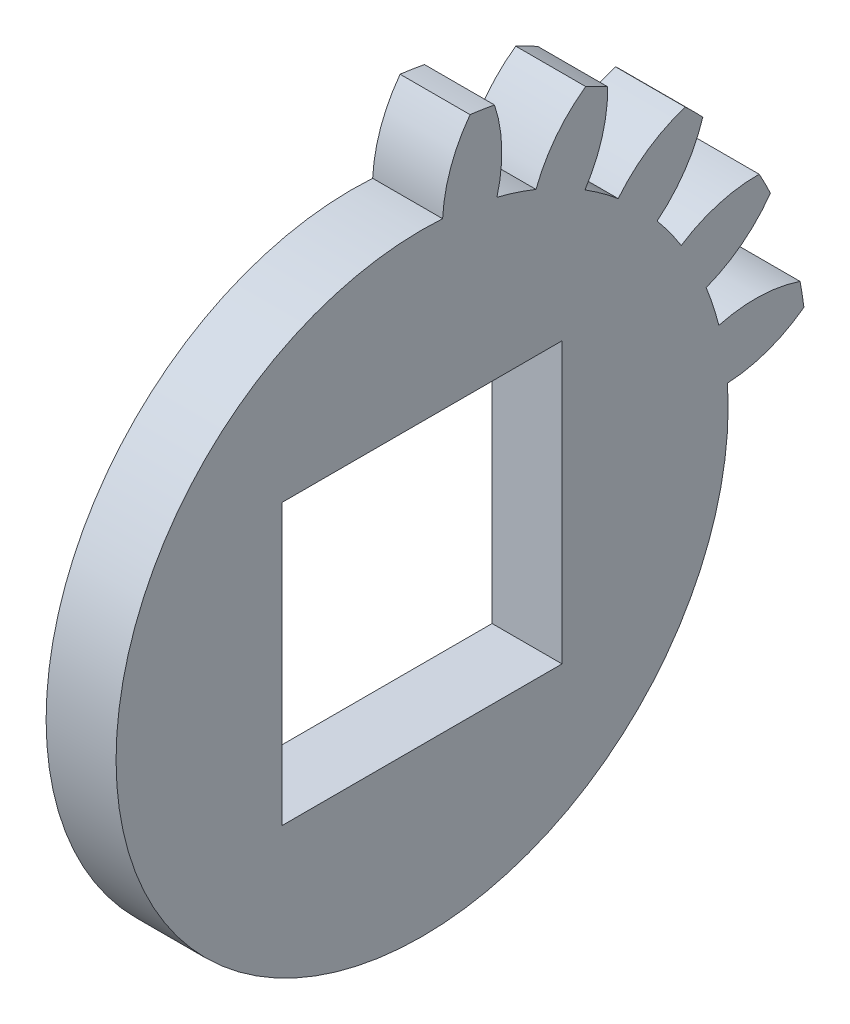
ISO-10303-21;
HEADER;
FILE_DESCRIPTION(('STEP AP214'),'2;1');
FILE_NAME('part.step','',(''),(''),'','','');
FILE_SCHEMA(('AUTOMOTIVE_DESIGN { 1 0 10303 214 1 1 1 1 }'));
ENDSEC;
DATA;
#1=APPLICATION_CONTEXT('core data for automotive mechanical design processes');
#2=APPLICATION_PROTOCOL_DEFINITION('international standard','automotive_design',2000,#1);
#3=PRODUCT_CONTEXT('',#1,'mechanical');
#4=PRODUCT('Part','Part','',(#3));
#5=PRODUCT_RELATED_PRODUCT_CATEGORY('part','',(#4));
#6=PRODUCT_DEFINITION_FORMATION('','',#4);
#7=PRODUCT_DEFINITION_CONTEXT('part definition',#1,'design');
#8=PRODUCT_DEFINITION('design','',#6,#7);
#9=PRODUCT_DEFINITION_SHAPE('','',#8);
#10=(LENGTH_UNIT() NAMED_UNIT(*) SI_UNIT(.MILLI.,.METRE.));
#11=(NAMED_UNIT(*) PLANE_ANGLE_UNIT() SI_UNIT($,.RADIAN.));
#12=(NAMED_UNIT(*) SI_UNIT($,.STERADIAN.) SOLID_ANGLE_UNIT());
#13=UNCERTAINTY_MEASURE_WITH_UNIT(LENGTH_MEASURE(1.E-05),#10,'distance_accuracy_value','');
#14=(GEOMETRIC_REPRESENTATION_CONTEXT(3) GLOBAL_UNCERTAINTY_ASSIGNED_CONTEXT((#13)) GLOBAL_UNIT_ASSIGNED_CONTEXT((#10,
#11,#12)) REPRESENTATION_CONTEXT('',''));
#15=CARTESIAN_POINT('',(0.,0.,0.));
#16=DIRECTION('',(0.,0.,1.));
#17=DIRECTION('',(1.,0.,0.));
#18=AXIS2_PLACEMENT_3D('',#15,#16,#17);
#19=CARTESIAN_POINT('',(2.38125,0.399546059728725,-0.399546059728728));
#20=DIRECTION('',(-1.,0.,0.));
#21=DIRECTION('',(0.,0.,1.));
#22=AXIS2_PLACEMENT_3D('',#19,#20,#21);
#23=PLANE('',#22);
#24=DIRECTION('',(0.,0.,-1.));
#25=VECTOR('',#24,1.);
#26=CARTESIAN_POINT('',(2.38125,-2.77545394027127,-3.57454605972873));
#27=LINE('',#26,#25);
#28=CARTESIAN_POINT('',(2.38125,-2.77545394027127,2.77545394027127));
#29=VERTEX_POINT('',#28);
#30=CARTESIAN_POINT('',(2.38125,-2.77545394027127,-3.57454605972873));
#31=VERTEX_POINT('',#30);
#32=EDGE_CURVE('E207',#29,#31,#27,.T.);
#33=ORIENTED_EDGE('',*,*,#32,.F.);
#34=DIRECTION('',(0.,-1.,0.));
#35=VECTOR('',#34,1.);
#36=CARTESIAN_POINT('',(2.38125,3.57454605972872,2.77545394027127));
#37=LINE('',#36,#35);
#38=CARTESIAN_POINT('',(2.38125,3.57454605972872,2.77545394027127));
#39=VERTEX_POINT('',#38);
#40=EDGE_CURVE('E49',#39,#29,#37,.T.);
#41=ORIENTED_EDGE('',*,*,#40,.F.);
#42=DIRECTION('',(0.,0.,1.));
#43=VECTOR('',#42,1.);
#44=CARTESIAN_POINT('',(2.38125,3.57454605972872,-3.57454605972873));
#45=LINE('',#44,#43);
#46=CARTESIAN_POINT('',(2.38125,3.57454605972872,-3.57454605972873));
#47=VERTEX_POINT('',#46);
#48=EDGE_CURVE('E213',#47,#39,#45,.T.);
#49=ORIENTED_EDGE('',*,*,#48,.F.);
#50=DIRECTION('',(0.,1.,0.));
#51=VECTOR('',#50,1.);
#52=CARTESIAN_POINT('',(2.38125,3.57454605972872,-3.57454605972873));
#53=LINE('',#52,#51);
#54=EDGE_CURVE('E198',#31,#47,#53,.T.);
#55=ORIENTED_EDGE('',*,*,#54,.F.);
#56=EDGE_LOOP('',(#33,#41,#49,#55));
#57=FACE_BOUND('',#56,.T.);
#58=CARTESIAN_POINT('',(2.38125,0.399546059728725,-0.399546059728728));
#59=DIRECTION('',(-1.,0.,0.));
#60=DIRECTION('',(0.,0.,-1.));
#61=AXIS2_PLACEMENT_3D('',#58,#59,#60);
#62=CIRCLE('',#61,6.9446775);
#63=CARTESIAN_POINT('',(2.38125,0.864922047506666,-7.32861315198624));
#64=VERTEX_POINT('',#63);
#65=CARTESIAN_POINT('',(2.38125,7.32861315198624,-0.864922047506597));
#66=VERTEX_POINT('',#65);
#67=EDGE_CURVE('E321',#64,#66,#62,.T.);
#68=ORIENTED_EDGE('',*,*,#67,.F.);
#69=CARTESIAN_POINT('',(2.38125,4.03592755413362,-7.16939921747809));
#70=DIRECTION('',(-1.,0.,0.));
#71=DIRECTION('',(0.,-1.,0.));
#72=AXIS2_PLACEMENT_3D('',#69,#70,#71);
#73=CIRCLE('',#72,3.175);
#74=CARTESIAN_POINT('',(2.38125,1.48725431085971,-9.06277971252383));
#75=VERTEX_POINT('',#74);
#76=EDGE_CURVE('E309',#75,#64,#73,.T.);
#77=ORIENTED_EDGE('',*,*,#76,.F.);
#78=CARTESIAN_POINT('',(2.38125,0.399546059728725,-0.399546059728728));
#79=DIRECTION('',(-1.,0.,0.));
#80=DIRECTION('',(0.,0.,1.));
#81=AXIS2_PLACEMENT_3D('',#78,#79,#80);
#82=CIRCLE('',#81,8.73125);
#83=CARTESIAN_POINT('',(2.38125,2.04216046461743,-8.97489121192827));
#84=VERTEX_POINT('',#83);
#85=EDGE_CURVE('E336',#84,#75,#82,.T.);
#86=ORIENTED_EDGE('',*,*,#85,.F.);
#87=CARTESIAN_POINT('',(2.38125,-0.966858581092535,-7.96176269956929));
#88=DIRECTION('',(-1.,0.,0.));
#89=DIRECTION('',(0.,-0.95105651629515,-0.309016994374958));
#90=AXIS2_PLACEMENT_3D('',#87,#88,#89);
#91=CIRCLE('',#90,3.175);
#92=CARTESIAN_POINT('',(2.38125,2.09814668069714,-7.13328955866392));
#93=VERTEX_POINT('',#92);
#94=EDGE_CURVE('E288',#93,#84,#91,.T.);
#95=ORIENTED_EDGE('',*,*,#94,.F.);
#96=CARTESIAN_POINT('',(2.38125,0.399546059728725,-0.399546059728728));
#97=DIRECTION('',(-1.,0.,0.));
#98=DIRECTION('',(0.,-0.95105651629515,-0.309016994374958));
#99=AXIS2_PLACEMENT_3D('',#96,#97,#98);
#100=CIRCLE('',#99,6.9446775);
#101=CARTESIAN_POINT('',(2.38125,2.98334441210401,-6.84567138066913));
#102=VERTEX_POINT('',#101);
#103=EDGE_CURVE('E293',#102,#93,#100,.T.);
#104=ORIENTED_EDGE('',*,*,#103,.F.);
#105=CARTESIAN_POINT('',(2.38125,5.94995005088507,-5.7143553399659));
#106=DIRECTION('',(-1.,0.,0.));
#107=DIRECTION('',(0.,-0.95105651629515,-0.309016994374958));
#108=AXIS2_PLACEMENT_3D('',#105,#106,#107);
#109=CIRCLE('',#108,3.175);
#110=CARTESIAN_POINT('',(2.38125,4.1111045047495,-8.30265054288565));
#111=VERTEX_POINT('',#110);
#112=EDGE_CURVE('E290',#111,#102,#109,.T.);
#113=ORIENTED_EDGE('',*,*,#112,.F.);
#114=CARTESIAN_POINT('',(2.38125,4.6116925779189,-8.04758817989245));
#115=VERTEX_POINT('',#114);
#116=EDGE_CURVE('E469',#115,#111,#82,.T.);
#117=ORIENTED_EDGE('',*,*,#116,.F.);
#118=CARTESIAN_POINT('',(2.38125,1.43687147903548,-8.0138837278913));
#119=DIRECTION('',(-1.,0.,0.));
#120=DIRECTION('',(0.,-0.80901699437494,-0.587785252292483));
#121=AXIS2_PLACEMENT_3D('',#118,#119,#120);
#122=CIRCLE('',#121,3.175);
#123=CARTESIAN_POINT('',(2.38125,4.09585242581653,-6.27882023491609));
#124=VERTEX_POINT('',#123);
#125=EDGE_CURVE('E266',#124,#115,#122,.T.);
#126=ORIENTED_EDGE('',*,*,#125,.F.);
#127=CARTESIAN_POINT('',(2.38125,0.399546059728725,-0.399546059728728));
#128=DIRECTION('',(-1.,0.,0.));
#129=DIRECTION('',(0.,-0.80901699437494,-0.587785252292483));
#130=AXIS2_PLACEMENT_3D('',#127,#128,#129);
#131=CIRCLE('',#130,6.9446775);
#132=CARTESIAN_POINT('',(2.38125,4.84884659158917,-5.73173795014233));
#133=VERTEX_POINT('',#132);
#134=EDGE_CURVE('E271',#133,#124,#131,.T.);
#135=ORIENTED_EDGE('',*,*,#134,.F.);
#136=CARTESIAN_POINT('',(2.38125,7.32066033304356,-3.73906089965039));
#137=DIRECTION('',(-1.,0.,0.));
#138=DIRECTION('',(0.,-0.80901699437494,-0.587785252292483));
#139=AXIS2_PLACEMENT_3D('',#136,#137,#138);
#140=CIRCLE('',#139,3.175);
#141=CARTESIAN_POINT('',(2.38125,6.37164149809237,-6.76891044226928));
#142=VERTEX_POINT('',#141);
#143=EDGE_CURVE('E268',#142,#133,#140,.T.);
#144=ORIENTED_EDGE('',*,*,#143,.F.);
#145=CARTESIAN_POINT('',(2.38125,6.76891044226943,-6.37164149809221));
#146=VERTEX_POINT('',#145);
#147=EDGE_CURVE('E470',#146,#142,#82,.T.);
#148=ORIENTED_EDGE('',*,*,#147,.F.);
#149=CARTESIAN_POINT('',(2.38125,3.73906089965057,-7.32066033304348));
#150=DIRECTION('',(-1.,0.,0.));
#151=DIRECTION('',(0.,-0.587785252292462,-0.809016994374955));
#152=AXIS2_PLACEMENT_3D('',#149,#150,#151);
#153=CIRCLE('',#152,3.175);
#154=CARTESIAN_POINT('',(2.38125,5.73173795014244,-4.84884659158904));
#155=VERTEX_POINT('',#154);
#156=EDGE_CURVE('E244',#155,#146,#153,.T.);
#157=ORIENTED_EDGE('',*,*,#156,.F.);
#158=CARTESIAN_POINT('',(2.38125,0.399546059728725,-0.399546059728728));
#159=DIRECTION('',(-1.,0.,0.));
#160=DIRECTION('',(0.,-0.587785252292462,-0.809016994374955));
#161=AXIS2_PLACEMENT_3D('',#158,#159,#160);
#162=CIRCLE('',#161,6.9446775);
#163=CARTESIAN_POINT('',(2.38125,6.27882023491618,-4.09585242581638));
#164=VERTEX_POINT('',#163);
#165=EDGE_CURVE('E249',#164,#155,#162,.T.);
#166=ORIENTED_EDGE('',*,*,#165,.F.);
#167=CARTESIAN_POINT('',(2.38125,8.01388372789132,-1.43687147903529));
#168=DIRECTION('',(-1.,0.,0.));
#169=DIRECTION('',(0.,-0.587785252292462,-0.809016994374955));
#170=AXIS2_PLACEMENT_3D('',#167,#168,#169);
#171=CIRCLE('',#170,3.175);
#172=CARTESIAN_POINT('',(2.38125,8.04758817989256,-4.6116925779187));
#173=VERTEX_POINT('',#172);
#174=EDGE_CURVE('E246',#173,#164,#171,.T.);
#175=ORIENTED_EDGE('',*,*,#174,.F.);
#176=CARTESIAN_POINT('',(2.38125,8.30265054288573,-4.11110450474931));
#177=VERTEX_POINT('',#176);
#178=EDGE_CURVE('E342',#177,#173,#82,.T.);
#179=ORIENTED_EDGE('',*,*,#178,.F.);
#180=CARTESIAN_POINT('',(2.38125,5.71435533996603,-5.94995005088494));
#181=DIRECTION('',(-1.,0.,0.));
#182=DIRECTION('',(0.,-0.309016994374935,-0.951056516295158));
#183=AXIS2_PLACEMENT_3D('',#180,#181,#182);
#184=CIRCLE('',#183,3.175);
#185=CARTESIAN_POINT('',(2.38125,6.84567138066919,-2.98334441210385));
#186=VERTEX_POINT('',#185);
#187=EDGE_CURVE('E223',#186,#177,#184,.T.);
#188=ORIENTED_EDGE('',*,*,#187,.F.);
#189=CARTESIAN_POINT('',(2.38125,0.399546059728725,-0.399546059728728));
#190=DIRECTION('',(-1.,0.,0.));
#191=DIRECTION('',(0.,-0.309016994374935,-0.951056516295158));
#192=AXIS2_PLACEMENT_3D('',#189,#190,#191);
#193=CIRCLE('',#192,6.9446775);
#194=CARTESIAN_POINT('',(2.38125,7.13328955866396,-2.09814668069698));
#195=VERTEX_POINT('',#194);
#196=EDGE_CURVE('E228',#195,#186,#193,.T.);
#197=ORIENTED_EDGE('',*,*,#196,.F.);
#198=CARTESIAN_POINT('',(2.38125,7.96176269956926,0.966858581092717));
#199=DIRECTION('',(-1.,0.,0.));
#200=DIRECTION('',(0.,-0.309016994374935,-0.951056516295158));
#201=AXIS2_PLACEMENT_3D('',#198,#199,#200);
#202=CIRCLE('',#201,3.175);
#203=CARTESIAN_POINT('',(2.38125,8.9748912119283,-2.04216046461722));
#204=VERTEX_POINT('',#203);
#205=EDGE_CURVE('E225',#204,#195,#202,.T.);
#206=ORIENTED_EDGE('',*,*,#205,.F.);
#207=CARTESIAN_POINT('',(2.38125,9.06277971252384,-1.48725431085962));
#208=VERTEX_POINT('',#207);
#209=EDGE_CURVE('E338',#208,#204,#82,.T.);
#210=ORIENTED_EDGE('',*,*,#209,.F.);
#211=CARTESIAN_POINT('',(2.38125,7.16939921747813,-4.03592755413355));
#212=DIRECTION('',(-1.,0.,0.));
#213=DIRECTION('',(0.,0.,-1.));
#214=AXIS2_PLACEMENT_3D('',#211,#212,#213);
#215=CIRCLE('',#214,3.175);
#216=EDGE_CURVE('E319',#66,#208,#215,.T.);
#217=ORIENTED_EDGE('',*,*,#216,.F.);
#218=EDGE_LOOP('',(#68,#77,#86,#95,#104,#113,#117,#126,#135,#144,#148,#157,#166,#175,#179,#188,
#197,#206,#210,#217));
#219=FACE_BOUND('',#218,.T.);
#220=ADVANCED_FACE('F35',(#57,#219),#23,.F.);
#221=CARTESIAN_POINT('',(0.79375,0.399546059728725,-0.399546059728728));
#222=DIRECTION('',(1.,0.,0.));
#223=DIRECTION('',(0.,0.,-1.));
#224=AXIS2_PLACEMENT_3D('',#221,#222,#223);
#225=PLANE('',#224);
#226=DIRECTION('',(0.,0.,1.));
#227=VECTOR('',#226,1.);
#228=CARTESIAN_POINT('',(0.79375,3.57454605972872,-0.399546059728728));
#229=LINE('',#228,#227);
#230=CARTESIAN_POINT('',(0.79375,3.57454605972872,-3.57454605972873));
#231=VERTEX_POINT('',#230);
#232=CARTESIAN_POINT('',(0.79375,3.57454605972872,2.77545394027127));
#233=VERTEX_POINT('',#232);
#234=EDGE_CURVE('E42',#231,#233,#229,.T.);
#235=ORIENTED_EDGE('',*,*,#234,.T.);
#236=DIRECTION('',(0.,-1.,0.));
#237=VECTOR('',#236,1.);
#238=CARTESIAN_POINT('',(0.79375,0.399546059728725,2.77545394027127));
#239=LINE('',#238,#237);
#240=CARTESIAN_POINT('',(0.79375,-2.77545394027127,2.77545394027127));
#241=VERTEX_POINT('',#240);
#242=EDGE_CURVE('E11',#233,#241,#239,.T.);
#243=ORIENTED_EDGE('',*,*,#242,.T.);
#244=DIRECTION('',(0.,0.,-1.));
#245=VECTOR('',#244,1.);
#246=CARTESIAN_POINT('',(0.79375,-2.77545394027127,-0.399546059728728));
#247=LINE('',#246,#245);
#248=CARTESIAN_POINT('',(0.79375,-2.77545394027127,-3.57454605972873));
#249=VERTEX_POINT('',#248);
#250=EDGE_CURVE('E356',#241,#249,#247,.T.);
#251=ORIENTED_EDGE('',*,*,#250,.T.);
#252=DIRECTION('',(0.,1.,0.));
#253=VECTOR('',#252,1.);
#254=CARTESIAN_POINT('',(0.79375,0.399546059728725,-3.57454605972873));
#255=LINE('',#254,#253);
#256=EDGE_CURVE('E201',#249,#231,#255,.T.);
#257=ORIENTED_EDGE('',*,*,#256,.T.);
#258=EDGE_LOOP('',(#235,#243,#251,#257));
#259=FACE_BOUND('',#258,.T.);
#260=CARTESIAN_POINT('',(0.79375,4.03592755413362,-7.16939921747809));
#261=DIRECTION('',(1.,0.,0.));
#262=DIRECTION('',(0.,0.,-1.));
#263=AXIS2_PLACEMENT_3D('',#260,#261,#262);
#264=CIRCLE('',#263,3.175);
#265=CARTESIAN_POINT('',(0.79375,0.864922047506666,-7.32861315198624));
#266=VERTEX_POINT('',#265);
#267=CARTESIAN_POINT('',(0.79375,1.48725431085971,-9.06277971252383));
#268=VERTEX_POINT('',#267);
#269=EDGE_CURVE('E341',#266,#268,#264,.T.);
#270=ORIENTED_EDGE('',*,*,#269,.F.);
#271=CARTESIAN_POINT('',(0.79375,0.399546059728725,-0.399546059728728));
#272=DIRECTION('',(-1.,0.,0.));
#273=DIRECTION('',(0.,0.,-1.));
#274=AXIS2_PLACEMENT_3D('',#271,#272,#273);
#275=CIRCLE('',#274,6.9446775);
#276=CARTESIAN_POINT('',(0.79375,7.32861315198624,-0.864922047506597));
#277=VERTEX_POINT('',#276);
#278=EDGE_CURVE('E322',#266,#277,#275,.T.);
#279=ORIENTED_EDGE('',*,*,#278,.T.);
#280=CARTESIAN_POINT('',(0.79375,7.16939921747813,-4.03592755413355));
#281=DIRECTION('',(-1.,0.,0.));
#282=DIRECTION('',(0.,0.,-1.));
#283=AXIS2_PLACEMENT_3D('',#280,#281,#282);
#284=CIRCLE('',#283,3.175);
#285=CARTESIAN_POINT('',(0.79375,9.06277971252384,-1.48725431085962));
#286=VERTEX_POINT('',#285);
#287=EDGE_CURVE('E318',#277,#286,#284,.T.);
#288=ORIENTED_EDGE('',*,*,#287,.T.);
#289=CARTESIAN_POINT('',(0.79375,0.399546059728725,-0.399546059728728));
#290=DIRECTION('',(-1.,0.,0.));
#291=DIRECTION('',(0.,0.,1.));
#292=AXIS2_PLACEMENT_3D('',#289,#290,#291);
#293=CIRCLE('',#292,8.73125);
#294=CARTESIAN_POINT('',(0.79375,8.9748912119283,-2.04216046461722));
#295=VERTEX_POINT('',#294);
#296=EDGE_CURVE('E333',#286,#295,#293,.T.);
#297=ORIENTED_EDGE('',*,*,#296,.T.);
#298=CARTESIAN_POINT('',(0.79375,7.96176269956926,0.966858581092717));
#299=DIRECTION('',(1.,0.,0.));
#300=DIRECTION('',(0.,0.,-1.));
#301=AXIS2_PLACEMENT_3D('',#298,#299,#300);
#302=CIRCLE('',#301,3.175);
#303=CARTESIAN_POINT('',(0.79375,7.13328955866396,-2.09814668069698));
#304=VERTEX_POINT('',#303);
#305=EDGE_CURVE('E354',#304,#295,#302,.T.);
#306=ORIENTED_EDGE('',*,*,#305,.F.);
#307=CARTESIAN_POINT('',(0.79375,0.399546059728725,-0.399546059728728));
#308=DIRECTION('',(-1.,0.,0.));
#309=DIRECTION('',(0.,-0.309016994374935,-0.951056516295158));
#310=AXIS2_PLACEMENT_3D('',#307,#308,#309);
#311=CIRCLE('',#310,6.9446775);
#312=CARTESIAN_POINT('',(0.79375,6.84567138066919,-2.98334441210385));
#313=VERTEX_POINT('',#312);
#314=EDGE_CURVE('E226',#304,#313,#311,.T.);
#315=ORIENTED_EDGE('',*,*,#314,.T.);
#316=CARTESIAN_POINT('',(0.79375,5.71435533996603,-5.94995005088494));
#317=DIRECTION('',(-1.,0.,0.));
#318=DIRECTION('',(0.,-0.309016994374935,-0.951056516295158));
#319=AXIS2_PLACEMENT_3D('',#316,#317,#318);
#320=CIRCLE('',#319,3.175);
#321=CARTESIAN_POINT('',(0.79375,8.30265054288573,-4.11110450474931));
#322=VERTEX_POINT('',#321);
#323=EDGE_CURVE('E220',#313,#322,#320,.T.);
#324=ORIENTED_EDGE('',*,*,#323,.T.);
#325=CARTESIAN_POINT('',(0.79375,8.04758817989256,-4.6116925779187));
#326=VERTEX_POINT('',#325);
#327=EDGE_CURVE('E337',#322,#326,#293,.T.);
#328=ORIENTED_EDGE('',*,*,#327,.T.);
#329=CARTESIAN_POINT('',(0.79375,8.01388372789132,-1.43687147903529));
#330=DIRECTION('',(1.,0.,0.));
#331=DIRECTION('',(0.,0.,-1.));
#332=AXIS2_PLACEMENT_3D('',#329,#330,#331);
#333=CIRCLE('',#332,3.175);
#334=CARTESIAN_POINT('',(0.79375,6.27882023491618,-4.09585242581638));
#335=VERTEX_POINT('',#334);
#336=EDGE_CURVE('E351',#335,#326,#333,.T.);
#337=ORIENTED_EDGE('',*,*,#336,.F.);
#338=CARTESIAN_POINT('',(0.79375,0.399546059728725,-0.399546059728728));
#339=DIRECTION('',(-1.,0.,0.));
#340=DIRECTION('',(0.,-0.587785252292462,-0.809016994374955));
#341=AXIS2_PLACEMENT_3D('',#338,#339,#340);
#342=CIRCLE('',#341,6.9446775);
#343=CARTESIAN_POINT('',(0.79375,5.73173795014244,-4.84884659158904));
#344=VERTEX_POINT('',#343);
#345=EDGE_CURVE('E247',#335,#344,#342,.T.);
#346=ORIENTED_EDGE('',*,*,#345,.T.);
#347=CARTESIAN_POINT('',(0.79375,3.73906089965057,-7.32066033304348));
#348=DIRECTION('',(-1.,0.,0.));
#349=DIRECTION('',(0.,-0.587785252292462,-0.809016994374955));
#350=AXIS2_PLACEMENT_3D('',#347,#348,#349);
#351=CIRCLE('',#350,3.175);
#352=CARTESIAN_POINT('',(0.79375,6.76891044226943,-6.37164149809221));
#353=VERTEX_POINT('',#352);
#354=EDGE_CURVE('E243',#344,#353,#351,.T.);
#355=ORIENTED_EDGE('',*,*,#354,.T.);
#356=CARTESIAN_POINT('',(0.79375,6.37164149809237,-6.76891044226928));
#357=VERTEX_POINT('',#356);
#358=EDGE_CURVE('E492',#353,#357,#293,.T.);
#359=ORIENTED_EDGE('',*,*,#358,.T.);
#360=CARTESIAN_POINT('',(0.79375,7.32066033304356,-3.73906089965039));
#361=DIRECTION('',(1.,0.,0.));
#362=DIRECTION('',(0.,0.,-1.));
#363=AXIS2_PLACEMENT_3D('',#360,#361,#362);
#364=CIRCLE('',#363,3.175);
#365=CARTESIAN_POINT('',(0.79375,4.84884659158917,-5.73173795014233));
#366=VERTEX_POINT('',#365);
#367=EDGE_CURVE('E348',#366,#357,#364,.T.);
#368=ORIENTED_EDGE('',*,*,#367,.F.);
#369=CARTESIAN_POINT('',(0.79375,0.399546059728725,-0.399546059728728));
#370=DIRECTION('',(-1.,0.,0.));
#371=DIRECTION('',(0.,-0.80901699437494,-0.587785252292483));
#372=AXIS2_PLACEMENT_3D('',#369,#370,#371);
#373=CIRCLE('',#372,6.9446775);
#374=CARTESIAN_POINT('',(0.79375,4.09585242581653,-6.27882023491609));
#375=VERTEX_POINT('',#374);
#376=EDGE_CURVE('E269',#366,#375,#373,.T.);
#377=ORIENTED_EDGE('',*,*,#376,.T.);
#378=CARTESIAN_POINT('',(0.79375,1.43687147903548,-8.0138837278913));
#379=DIRECTION('',(-1.,0.,0.));
#380=DIRECTION('',(0.,-0.80901699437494,-0.587785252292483));
#381=AXIS2_PLACEMENT_3D('',#378,#379,#380);
#382=CIRCLE('',#381,3.175);
#383=CARTESIAN_POINT('',(0.79375,4.61169257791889,-8.04758817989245));
#384=VERTEX_POINT('',#383);
#385=EDGE_CURVE('E265',#375,#384,#382,.T.);
#386=ORIENTED_EDGE('',*,*,#385,.T.);
#387=CARTESIAN_POINT('',(0.79375,4.1111045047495,-8.30265054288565));
#388=VERTEX_POINT('',#387);
#389=EDGE_CURVE('E494',#384,#388,#293,.T.);
#390=ORIENTED_EDGE('',*,*,#389,.T.);
#391=CARTESIAN_POINT('',(0.79375,5.94995005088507,-5.7143553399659));
#392=DIRECTION('',(1.,0.,0.));
#393=DIRECTION('',(0.,0.,-1.));
#394=AXIS2_PLACEMENT_3D('',#391,#392,#393);
#395=CIRCLE('',#394,3.175);
#396=CARTESIAN_POINT('',(0.79375,2.98334441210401,-6.84567138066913));
#397=VERTEX_POINT('',#396);
#398=EDGE_CURVE('E345',#397,#388,#395,.T.);
#399=ORIENTED_EDGE('',*,*,#398,.F.);
#400=CARTESIAN_POINT('',(0.79375,0.399546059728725,-0.399546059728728));
#401=DIRECTION('',(-1.,0.,0.));
#402=DIRECTION('',(0.,-0.95105651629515,-0.309016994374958));
#403=AXIS2_PLACEMENT_3D('',#400,#401,#402);
#404=CIRCLE('',#403,6.9446775);
#405=CARTESIAN_POINT('',(0.79375,2.09814668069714,-7.13328955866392));
#406=VERTEX_POINT('',#405);
#407=EDGE_CURVE('E291',#397,#406,#404,.T.);
#408=ORIENTED_EDGE('',*,*,#407,.T.);
#409=CARTESIAN_POINT('',(0.79375,-0.966858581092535,-7.96176269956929));
#410=DIRECTION('',(-1.,0.,0.));
#411=DIRECTION('',(0.,-0.95105651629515,-0.309016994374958));
#412=AXIS2_PLACEMENT_3D('',#409,#410,#411);
#413=CIRCLE('',#412,3.175);
#414=CARTESIAN_POINT('',(0.79375,2.04216046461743,-8.97489121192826));
#415=VERTEX_POINT('',#414);
#416=EDGE_CURVE('E287',#406,#415,#413,.T.);
#417=ORIENTED_EDGE('',*,*,#416,.T.);
#418=EDGE_CURVE('E332',#415,#268,#293,.T.);
#419=ORIENTED_EDGE('',*,*,#418,.T.);
#420=EDGE_LOOP('',(#270,#279,#288,#297,#306,#315,#324,#328,#337,#346,#355,#359,#368,#377,#386,
#390,#399,#408,#417,#419));
#421=FACE_BOUND('',#420,.T.);
#422=ADVANCED_FACE('F360',(#259,#421),#225,.F.);
#423=CARTESIAN_POINT('',(-4.20625,0.399546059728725,-0.399546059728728));
#424=DIRECTION('',(-1.,0.,0.));
#425=DIRECTION('',(0.,0.,1.));
#426=AXIS2_PLACEMENT_3D('',#423,#424,#425);
#427=CYLINDRICAL_SURFACE('',#426,8.73125);
#428=DIRECTION('',(-1.,0.,0.));
#429=VECTOR('',#428,1.);
#430=CARTESIAN_POINT('',(1.5875,8.30265054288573,-4.11110450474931));
#431=LINE('',#430,#429);
#432=EDGE_CURVE('E241',#177,#322,#431,.T.);
#433=ORIENTED_EDGE('',*,*,#432,.F.);
#434=ORIENTED_EDGE('',*,*,#178,.T.);
#435=DIRECTION('',(-1.,0.,0.));
#436=VECTOR('',#435,1.);
#437=CARTESIAN_POINT('',(1.5875,8.04758817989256,-4.6116925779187));
#438=LINE('',#437,#436);
#439=EDGE_CURVE('E260',#326,#173,#438,.F.);
#440=ORIENTED_EDGE('',*,*,#439,.F.);
#441=ORIENTED_EDGE('',*,*,#327,.F.);
#442=EDGE_LOOP('',(#433,#434,#440,#441));
#443=FACE_BOUND('',#442,.T.);
#444=ADVANCED_FACE('F382',(#443),#427,.T.);
#445=DIRECTION('',(-1.,0.,0.));
#446=VECTOR('',#445,1.);
#447=CARTESIAN_POINT('',(1.5875,8.9748912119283,-2.04216046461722));
#448=LINE('',#447,#446);
#449=EDGE_CURVE('E239',#295,#204,#448,.F.);
#450=ORIENTED_EDGE('',*,*,#449,.F.);
#451=ORIENTED_EDGE('',*,*,#296,.F.);
#452=DIRECTION('',(-1.,0.,0.));
#453=VECTOR('',#452,1.);
#454=CARTESIAN_POINT('',(1.5875,9.06277971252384,-1.48725431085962));
#455=LINE('',#454,#453);
#456=EDGE_CURVE('E330',#208,#286,#455,.T.);
#457=ORIENTED_EDGE('',*,*,#456,.F.);
#458=ORIENTED_EDGE('',*,*,#209,.T.);
#459=EDGE_LOOP('',(#450,#451,#457,#458));
#460=FACE_BOUND('',#459,.T.);
#461=ADVANCED_FACE('F387',(#460),#427,.T.);
#462=DIRECTION('',(-1.,0.,0.));
#463=VECTOR('',#462,1.);
#464=CARTESIAN_POINT('',(1.5875,6.76891044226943,-6.37164149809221));
#465=LINE('',#464,#463);
#466=EDGE_CURVE('E263',#146,#353,#465,.T.);
#467=ORIENTED_EDGE('',*,*,#466,.F.);
#468=ORIENTED_EDGE('',*,*,#147,.T.);
#469=DIRECTION('',(-1.,0.,0.));
#470=VECTOR('',#469,1.);
#471=CARTESIAN_POINT('',(1.5875,6.37164149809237,-6.76891044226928));
#472=LINE('',#471,#470);
#473=EDGE_CURVE('E282',#357,#142,#472,.F.);
#474=ORIENTED_EDGE('',*,*,#473,.F.);
#475=ORIENTED_EDGE('',*,*,#358,.F.);
#476=EDGE_LOOP('',(#467,#468,#474,#475));
#477=FACE_BOUND('',#476,.T.);
#478=ADVANCED_FACE('F493',(#477),#427,.T.);
#479=DIRECTION('',(-1.,0.,0.));
#480=VECTOR('',#479,1.);
#481=CARTESIAN_POINT('',(1.5875,4.6116925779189,-8.04758817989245));
#482=LINE('',#481,#480);
#483=EDGE_CURVE('E285',#115,#384,#482,.T.);
#484=ORIENTED_EDGE('',*,*,#483,.F.);
#485=ORIENTED_EDGE('',*,*,#116,.T.);
#486=DIRECTION('',(-1.,0.,0.));
#487=VECTOR('',#486,1.);
#488=CARTESIAN_POINT('',(1.5875,4.1111045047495,-8.30265054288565));
#489=LINE('',#488,#487);
#490=EDGE_CURVE('E304',#388,#111,#489,.F.);
#491=ORIENTED_EDGE('',*,*,#490,.F.);
#492=ORIENTED_EDGE('',*,*,#389,.F.);
#493=EDGE_LOOP('',(#484,#485,#491,#492));
#494=FACE_BOUND('',#493,.T.);
#495=ADVANCED_FACE('F502',(#494),#427,.T.);
#496=DIRECTION('',(-1.,0.,0.));
#497=VECTOR('',#496,1.);
#498=CARTESIAN_POINT('',(1.5875,2.04216046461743,-8.97489121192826));
#499=LINE('',#498,#497);
#500=EDGE_CURVE('E307',#84,#415,#499,.T.);
#501=ORIENTED_EDGE('',*,*,#500,.F.);
#502=ORIENTED_EDGE('',*,*,#85,.T.);
#503=DIRECTION('',(-1.,0.,0.));
#504=VECTOR('',#503,1.);
#505=CARTESIAN_POINT('',(1.5875,1.48725431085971,-9.06277971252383));
#506=LINE('',#505,#504);
#507=EDGE_CURVE('E315',#268,#75,#506,.F.);
#508=ORIENTED_EDGE('',*,*,#507,.F.);
#509=ORIENTED_EDGE('',*,*,#418,.F.);
#510=EDGE_LOOP('',(#501,#502,#508,#509));
#511=FACE_BOUND('',#510,.T.);
#512=ADVANCED_FACE('F389',(#511),#427,.T.);
#513=CARTESIAN_POINT('',(2.38125,7.16939921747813,-4.03592755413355));
#514=DIRECTION('',(-1.,0.,0.));
#515=DIRECTION('',(0.,0.,1.));
#516=AXIS2_PLACEMENT_3D('',#513,#514,#515);
#517=CYLINDRICAL_SURFACE('',#516,3.175);
#518=ORIENTED_EDGE('',*,*,#456,.T.);
#519=ORIENTED_EDGE('',*,*,#287,.F.);
#520=DIRECTION('',(-1.,0.,0.));
#521=VECTOR('',#520,1.);
#522=CARTESIAN_POINT('',(2.38125,7.32861315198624,-0.864922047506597));
#523=LINE('',#522,#521);
#524=EDGE_CURVE('E324',#66,#277,#523,.T.);
#525=ORIENTED_EDGE('',*,*,#524,.F.);
#526=ORIENTED_EDGE('',*,*,#216,.T.);
#527=EDGE_LOOP('',(#518,#519,#525,#526));
#528=FACE_BOUND('',#527,.T.);
#529=ADVANCED_FACE('F391',(#528),#517,.T.);
#530=CARTESIAN_POINT('',(2.38125,0.399546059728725,-0.399546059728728));
#531=DIRECTION('',(-1.,0.,0.));
#532=DIRECTION('',(0.,0.,1.));
#533=AXIS2_PLACEMENT_3D('',#530,#531,#532);
#534=CYLINDRICAL_SURFACE('',#533,6.9446775);
#535=ORIENTED_EDGE('',*,*,#67,.T.);
#536=ORIENTED_EDGE('',*,*,#524,.T.);
#537=ORIENTED_EDGE('',*,*,#278,.F.);
#538=DIRECTION('',(-1.,0.,0.));
#539=VECTOR('',#538,1.);
#540=CARTESIAN_POINT('',(2.38125,0.864922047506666,-7.32861315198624));
#541=LINE('',#540,#539);
#542=EDGE_CURVE('E312',#64,#266,#541,.T.);
#543=ORIENTED_EDGE('',*,*,#542,.F.);
#544=EDGE_LOOP('',(#535,#536,#537,#543));
#545=FACE_BOUND('',#544,.T.);
#546=ADVANCED_FACE('F394',(#545),#534,.T.);
#547=CARTESIAN_POINT('',(2.38125,4.03592755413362,-7.16939921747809));
#548=DIRECTION('',(-1.,0.,0.));
#549=DIRECTION('',(0.,0.,1.));
#550=AXIS2_PLACEMENT_3D('',#547,#548,#549);
#551=CYLINDRICAL_SURFACE('',#550,3.175);
#552=ORIENTED_EDGE('',*,*,#507,.T.);
#553=ORIENTED_EDGE('',*,*,#76,.T.);
#554=ORIENTED_EDGE('',*,*,#542,.T.);
#555=ORIENTED_EDGE('',*,*,#269,.T.);
#556=EDGE_LOOP('',(#552,#553,#554,#555));
#557=FACE_BOUND('',#556,.T.);
#558=ADVANCED_FACE('F398',(#557),#551,.T.);
#559=CARTESIAN_POINT('',(2.38125,-0.966858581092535,-7.96176269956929));
#560=DIRECTION('',(-1.,0.,0.));
#561=DIRECTION('',(0.,0.,1.));
#562=AXIS2_PLACEMENT_3D('',#559,#560,#561);
#563=CYLINDRICAL_SURFACE('',#562,3.175);
#564=ORIENTED_EDGE('',*,*,#500,.T.);
#565=ORIENTED_EDGE('',*,*,#416,.F.);
#566=DIRECTION('',(-1.,0.,0.));
#567=VECTOR('',#566,1.);
#568=CARTESIAN_POINT('',(2.38125,2.09814668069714,-7.13328955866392));
#569=LINE('',#568,#567);
#570=EDGE_CURVE('E295',#93,#406,#569,.T.);
#571=ORIENTED_EDGE('',*,*,#570,.F.);
#572=ORIENTED_EDGE('',*,*,#94,.T.);
#573=EDGE_LOOP('',(#564,#565,#571,#572));
#574=FACE_BOUND('',#573,.T.);
#575=ADVANCED_FACE('F402',(#574),#563,.T.);
#576=CARTESIAN_POINT('',(2.38125,5.94995005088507,-5.7143553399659));
#577=DIRECTION('',(-1.,0.,0.));
#578=DIRECTION('',(0.,0.,1.));
#579=AXIS2_PLACEMENT_3D('',#576,#577,#578);
#580=CYLINDRICAL_SURFACE('',#579,3.175);
#581=ORIENTED_EDGE('',*,*,#490,.T.);
#582=ORIENTED_EDGE('',*,*,#112,.T.);
#583=DIRECTION('',(-1.,0.,0.));
#584=VECTOR('',#583,1.);
#585=CARTESIAN_POINT('',(2.38125,2.98334441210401,-6.84567138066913));
#586=LINE('',#585,#584);
#587=EDGE_CURVE('E302',#102,#397,#586,.T.);
#588=ORIENTED_EDGE('',*,*,#587,.T.);
#589=ORIENTED_EDGE('',*,*,#398,.T.);
#590=EDGE_LOOP('',(#581,#582,#588,#589));
#591=FACE_BOUND('',#590,.T.);
#592=ADVANCED_FACE('F406',(#591),#580,.T.);
#593=CARTESIAN_POINT('',(2.38125,0.399546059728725,-0.399546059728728));
#594=DIRECTION('',(-1.,0.,0.));
#595=DIRECTION('',(0.,0.,1.));
#596=AXIS2_PLACEMENT_3D('',#593,#594,#595);
#597=CYLINDRICAL_SURFACE('',#596,6.9446775);
#598=ORIENTED_EDGE('',*,*,#407,.F.);
#599=ORIENTED_EDGE('',*,*,#587,.F.);
#600=ORIENTED_EDGE('',*,*,#103,.T.);
#601=ORIENTED_EDGE('',*,*,#570,.T.);
#602=EDGE_LOOP('',(#598,#599,#600,#601));
#603=FACE_BOUND('',#602,.T.);
#604=ADVANCED_FACE('F410',(#603),#597,.T.);
#605=CARTESIAN_POINT('',(2.38125,1.43687147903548,-8.0138837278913));
#606=DIRECTION('',(-1.,0.,0.));
#607=DIRECTION('',(0.,0.,1.));
#608=AXIS2_PLACEMENT_3D('',#605,#606,#607);
#609=CYLINDRICAL_SURFACE('',#608,3.175);
#610=ORIENTED_EDGE('',*,*,#483,.T.);
#611=ORIENTED_EDGE('',*,*,#385,.F.);
#612=DIRECTION('',(-1.,0.,0.));
#613=VECTOR('',#612,1.);
#614=CARTESIAN_POINT('',(2.38125,4.09585242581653,-6.27882023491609));
#615=LINE('',#614,#613);
#616=EDGE_CURVE('E273',#124,#375,#615,.T.);
#617=ORIENTED_EDGE('',*,*,#616,.F.);
#618=ORIENTED_EDGE('',*,*,#125,.T.);
#619=EDGE_LOOP('',(#610,#611,#617,#618));
#620=FACE_BOUND('',#619,.T.);
#621=ADVANCED_FACE('F414',(#620),#609,.T.);
#622=CARTESIAN_POINT('',(2.38125,7.32066033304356,-3.73906089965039));
#623=DIRECTION('',(-1.,0.,0.));
#624=DIRECTION('',(0.,0.,1.));
#625=AXIS2_PLACEMENT_3D('',#622,#623,#624);
#626=CYLINDRICAL_SURFACE('',#625,3.175);
#627=ORIENTED_EDGE('',*,*,#473,.T.);
#628=ORIENTED_EDGE('',*,*,#143,.T.);
#629=DIRECTION('',(-1.,0.,0.));
#630=VECTOR('',#629,1.);
#631=CARTESIAN_POINT('',(2.38125,4.84884659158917,-5.73173795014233));
#632=LINE('',#631,#630);
#633=EDGE_CURVE('E280',#133,#366,#632,.T.);
#634=ORIENTED_EDGE('',*,*,#633,.T.);
#635=ORIENTED_EDGE('',*,*,#367,.T.);
#636=EDGE_LOOP('',(#627,#628,#634,#635));
#637=FACE_BOUND('',#636,.T.);
#638=ADVANCED_FACE('F418',(#637),#626,.T.);
#639=CARTESIAN_POINT('',(2.38125,0.399546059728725,-0.399546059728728));
#640=DIRECTION('',(-1.,0.,0.));
#641=DIRECTION('',(0.,0.,1.));
#642=AXIS2_PLACEMENT_3D('',#639,#640,#641);
#643=CYLINDRICAL_SURFACE('',#642,6.9446775);
#644=ORIENTED_EDGE('',*,*,#376,.F.);
#645=ORIENTED_EDGE('',*,*,#633,.F.);
#646=ORIENTED_EDGE('',*,*,#134,.T.);
#647=ORIENTED_EDGE('',*,*,#616,.T.);
#648=EDGE_LOOP('',(#644,#645,#646,#647));
#649=FACE_BOUND('',#648,.T.);
#650=ADVANCED_FACE('F422',(#649),#643,.T.);
#651=CARTESIAN_POINT('',(2.38125,3.73906089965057,-7.32066033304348));
#652=DIRECTION('',(-1.,0.,0.));
#653=DIRECTION('',(0.,0.,1.));
#654=AXIS2_PLACEMENT_3D('',#651,#652,#653);
#655=CYLINDRICAL_SURFACE('',#654,3.175);
#656=ORIENTED_EDGE('',*,*,#466,.T.);
#657=ORIENTED_EDGE('',*,*,#354,.F.);
#658=DIRECTION('',(-1.,0.,0.));
#659=VECTOR('',#658,1.);
#660=CARTESIAN_POINT('',(2.38125,5.73173795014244,-4.84884659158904));
#661=LINE('',#660,#659);
#662=EDGE_CURVE('E251',#155,#344,#661,.T.);
#663=ORIENTED_EDGE('',*,*,#662,.F.);
#664=ORIENTED_EDGE('',*,*,#156,.T.);
#665=EDGE_LOOP('',(#656,#657,#663,#664));
#666=FACE_BOUND('',#665,.T.);
#667=ADVANCED_FACE('F426',(#666),#655,.T.);
#668=CARTESIAN_POINT('',(2.38125,8.01388372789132,-1.43687147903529));
#669=DIRECTION('',(-1.,0.,0.));
#670=DIRECTION('',(0.,0.,1.));
#671=AXIS2_PLACEMENT_3D('',#668,#669,#670);
#672=CYLINDRICAL_SURFACE('',#671,3.175);
#673=ORIENTED_EDGE('',*,*,#439,.T.);
#674=ORIENTED_EDGE('',*,*,#174,.T.);
#675=DIRECTION('',(-1.,0.,0.));
#676=VECTOR('',#675,1.);
#677=CARTESIAN_POINT('',(2.38125,6.27882023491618,-4.09585242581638));
#678=LINE('',#677,#676);
#679=EDGE_CURVE('E258',#164,#335,#678,.T.);
#680=ORIENTED_EDGE('',*,*,#679,.T.);
#681=ORIENTED_EDGE('',*,*,#336,.T.);
#682=EDGE_LOOP('',(#673,#674,#680,#681));
#683=FACE_BOUND('',#682,.T.);
#684=ADVANCED_FACE('F430',(#683),#672,.T.);
#685=CARTESIAN_POINT('',(2.38125,0.399546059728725,-0.399546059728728));
#686=DIRECTION('',(-1.,0.,0.));
#687=DIRECTION('',(0.,0.,1.));
#688=AXIS2_PLACEMENT_3D('',#685,#686,#687);
#689=CYLINDRICAL_SURFACE('',#688,6.9446775);
#690=ORIENTED_EDGE('',*,*,#345,.F.);
#691=ORIENTED_EDGE('',*,*,#679,.F.);
#692=ORIENTED_EDGE('',*,*,#165,.T.);
#693=ORIENTED_EDGE('',*,*,#662,.T.);
#694=EDGE_LOOP('',(#690,#691,#692,#693));
#695=FACE_BOUND('',#694,.T.);
#696=ADVANCED_FACE('F434',(#695),#689,.T.);
#697=CARTESIAN_POINT('',(2.38125,5.71435533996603,-5.94995005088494));
#698=DIRECTION('',(-1.,0.,0.));
#699=DIRECTION('',(0.,0.,1.));
#700=AXIS2_PLACEMENT_3D('',#697,#698,#699);
#701=CYLINDRICAL_SURFACE('',#700,3.175);
#702=ORIENTED_EDGE('',*,*,#432,.T.);
#703=ORIENTED_EDGE('',*,*,#323,.F.);
#704=DIRECTION('',(-1.,0.,0.));
#705=VECTOR('',#704,1.);
#706=CARTESIAN_POINT('',(2.38125,6.84567138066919,-2.98334441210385));
#707=LINE('',#706,#705);
#708=EDGE_CURVE('E230',#186,#313,#707,.T.);
#709=ORIENTED_EDGE('',*,*,#708,.F.);
#710=ORIENTED_EDGE('',*,*,#187,.T.);
#711=EDGE_LOOP('',(#702,#703,#709,#710));
#712=FACE_BOUND('',#711,.T.);
#713=ADVANCED_FACE('F438',(#712),#701,.T.);
#714=CARTESIAN_POINT('',(2.38125,7.96176269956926,0.966858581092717));
#715=DIRECTION('',(-1.,0.,0.));
#716=DIRECTION('',(0.,0.,1.));
#717=AXIS2_PLACEMENT_3D('',#714,#715,#716);
#718=CYLINDRICAL_SURFACE('',#717,3.175);
#719=ORIENTED_EDGE('',*,*,#449,.T.);
#720=ORIENTED_EDGE('',*,*,#205,.T.);
#721=DIRECTION('',(-1.,0.,0.));
#722=VECTOR('',#721,1.);
#723=CARTESIAN_POINT('',(2.38125,7.13328955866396,-2.09814668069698));
#724=LINE('',#723,#722);
#725=EDGE_CURVE('E237',#195,#304,#724,.T.);
#726=ORIENTED_EDGE('',*,*,#725,.T.);
#727=ORIENTED_EDGE('',*,*,#305,.T.);
#728=EDGE_LOOP('',(#719,#720,#726,#727));
#729=FACE_BOUND('',#728,.T.);
#730=ADVANCED_FACE('F374',(#729),#718,.T.);
#731=CARTESIAN_POINT('',(2.38125,0.399546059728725,-0.399546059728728));
#732=DIRECTION('',(-1.,0.,0.));
#733=DIRECTION('',(0.,0.,1.));
#734=AXIS2_PLACEMENT_3D('',#731,#732,#733);
#735=CYLINDRICAL_SURFACE('',#734,6.9446775);
#736=ORIENTED_EDGE('',*,*,#314,.F.);
#737=ORIENTED_EDGE('',*,*,#725,.F.);
#738=ORIENTED_EDGE('',*,*,#196,.T.);
#739=ORIENTED_EDGE('',*,*,#708,.T.);
#740=EDGE_LOOP('',(#736,#737,#738,#739));
#741=FACE_BOUND('',#740,.T.);
#742=ADVANCED_FACE('F367',(#741),#735,.T.);
#743=CARTESIAN_POINT('',(-0.15875,3.57454605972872,2.77545394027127));
#744=DIRECTION('',(0.,0.,1.));
#745=DIRECTION('',(0.,-1.,0.));
#746=AXIS2_PLACEMENT_3D('',#743,#744,#745);
#747=PLANE('',#746);
#748=DIRECTION('',(1.,0.,0.));
#749=VECTOR('',#748,1.);
#750=CARTESIAN_POINT('',(-0.15875,3.57454605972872,2.77545394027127));
#751=LINE('',#750,#749);
#752=EDGE_CURVE('E218',#233,#39,#751,.T.);
#753=ORIENTED_EDGE('',*,*,#752,.T.);
#754=ORIENTED_EDGE('',*,*,#40,.T.);
#755=DIRECTION('',(1.,0.,0.));
#756=VECTOR('',#755,1.);
#757=CARTESIAN_POINT('',(-0.15875,-2.77545394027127,2.77545394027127));
#758=LINE('',#757,#756);
#759=EDGE_CURVE('E204',#241,#29,#758,.T.);
#760=ORIENTED_EDGE('',*,*,#759,.F.);
#761=ORIENTED_EDGE('',*,*,#242,.F.);
#762=EDGE_LOOP('',(#753,#754,#760,#761));
#763=FACE_BOUND('',#762,.T.);
#764=ADVANCED_FACE('F365',(#763),#747,.F.);
#765=CARTESIAN_POINT('',(-0.15875,3.57454605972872,-3.57454605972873));
#766=DIRECTION('',(0.,1.,0.));
#767=DIRECTION('',(0.,0.,1.));
#768=AXIS2_PLACEMENT_3D('',#765,#766,#767);
#769=PLANE('',#768);
#770=DIRECTION('',(1.,0.,0.));
#771=VECTOR('',#770,1.);
#772=CARTESIAN_POINT('',(-0.15875,3.57454605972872,-3.57454605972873));
#773=LINE('',#772,#771);
#774=EDGE_CURVE('E203',#231,#47,#773,.T.);
#775=ORIENTED_EDGE('',*,*,#774,.T.);
#776=ORIENTED_EDGE('',*,*,#48,.T.);
#777=ORIENTED_EDGE('',*,*,#752,.F.);
#778=ORIENTED_EDGE('',*,*,#234,.F.);
#779=EDGE_LOOP('',(#775,#776,#777,#778));
#780=FACE_BOUND('',#779,.T.);
#781=ADVANCED_FACE('F364',(#780),#769,.F.);
#782=CARTESIAN_POINT('',(-0.15875,3.57454605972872,-3.57454605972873));
#783=DIRECTION('',(0.,0.,-1.));
#784=DIRECTION('',(0.,1.,0.));
#785=AXIS2_PLACEMENT_3D('',#782,#783,#784);
#786=PLANE('',#785);
#787=DIRECTION('',(1.,0.,0.));
#788=VECTOR('',#787,1.);
#789=CARTESIAN_POINT('',(-0.15875,-2.77545394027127,-3.57454605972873));
#790=LINE('',#789,#788);
#791=EDGE_CURVE('E57',#249,#31,#790,.T.);
#792=ORIENTED_EDGE('',*,*,#791,.T.);
#793=ORIENTED_EDGE('',*,*,#54,.T.);
#794=ORIENTED_EDGE('',*,*,#774,.F.);
#795=ORIENTED_EDGE('',*,*,#256,.F.);
#796=EDGE_LOOP('',(#792,#793,#794,#795));
#797=FACE_BOUND('',#796,.T.);
#798=ADVANCED_FACE('F195',(#797),#786,.F.);
#799=CARTESIAN_POINT('',(-0.15875,-2.77545394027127,-3.57454605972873));
#800=DIRECTION('',(0.,-1.,0.));
#801=DIRECTION('',(0.,0.,-1.));
#802=AXIS2_PLACEMENT_3D('',#799,#800,#801);
#803=PLANE('',#802);
#804=ORIENTED_EDGE('',*,*,#759,.T.);
#805=ORIENTED_EDGE('',*,*,#32,.T.);
#806=ORIENTED_EDGE('',*,*,#791,.F.);
#807=ORIENTED_EDGE('',*,*,#250,.F.);
#808=EDGE_LOOP('',(#804,#805,#806,#807));
#809=FACE_BOUND('',#808,.T.);
#810=ADVANCED_FACE('F208',(#809),#803,.F.);
#811=CLOSED_SHELL('',(#220,#422,#444,#461,#478,#495,#512,#529,#546,#558,#575,#592,#604,#621,
#638,#650,#667,#684,#696,#713,#730,#742,#764,#781,#798,#810));
#812=MANIFOLD_SOLID_BREP('B2',#811);
#813=ADVANCED_BREP_SHAPE_REPRESENTATION('',(#18,#812),#14);
#814=SHAPE_DEFINITION_REPRESENTATION(#9,#813);
ENDSEC;
END-ISO-10303-21;
